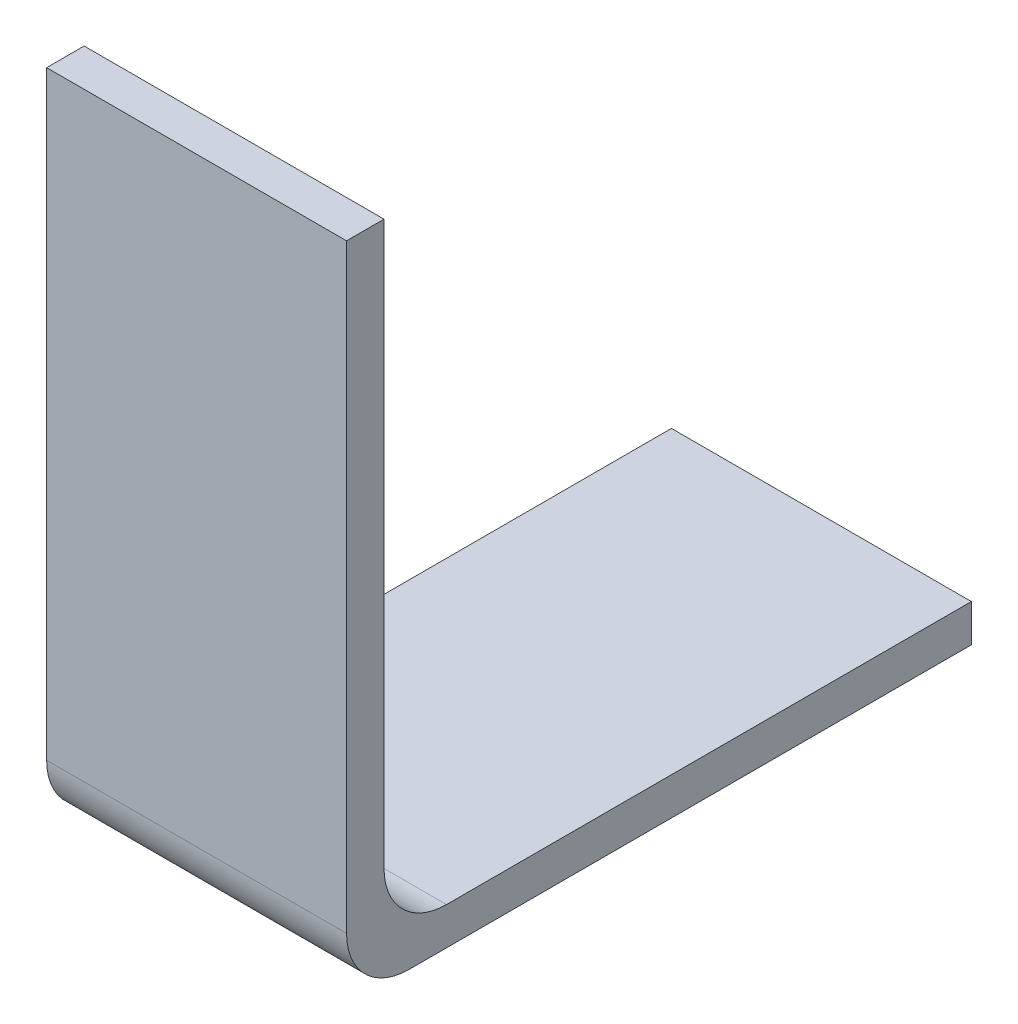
from build123d import *

# Parameters (mm, degrees)
SKETCH1_W           = 6.096
SKETCH1_H           = 0.762
BASE_EXTRUDE_DEPTH  = 12.7
SKETCH2_W           = 6.096
SKETCH2_H           = 0.762
BOSS_EXTRUDE1_DEPTH = 12.7
FILLET1_R           = 1.27


with BuildPart() as part:
    # Sketch1 → Base-Extrude (new body)
    with BuildSketch(Plane.XY):
        with Locations((3.048, -0.381)):
            Rectangle(SKETCH1_W, SKETCH1_H)
    extrude(amount=BASE_EXTRUDE_DEPTH)

    # Sketch2 → Boss-Extrude1 (add)
    with BuildSketch(Plane(origin=(0, 0, 0), x_dir=(-1, 0, 0), z_dir=(0, 1, 0))):
        with Locations((-3.048, 12.319)):
            Rectangle(SKETCH2_W, SKETCH2_H)
    extrude(amount=BOSS_EXTRUDE1_DEPTH)

    # Fillet1
    fillet1_edges = [part.edges().sort_by_distance(p)[0] for p in [
        (3.048, 0, 11.938),
        (3.048, -0.762, 12.7),
    ]]
    fillet(fillet1_edges, radius=FILLET1_R)


solid = part.part
